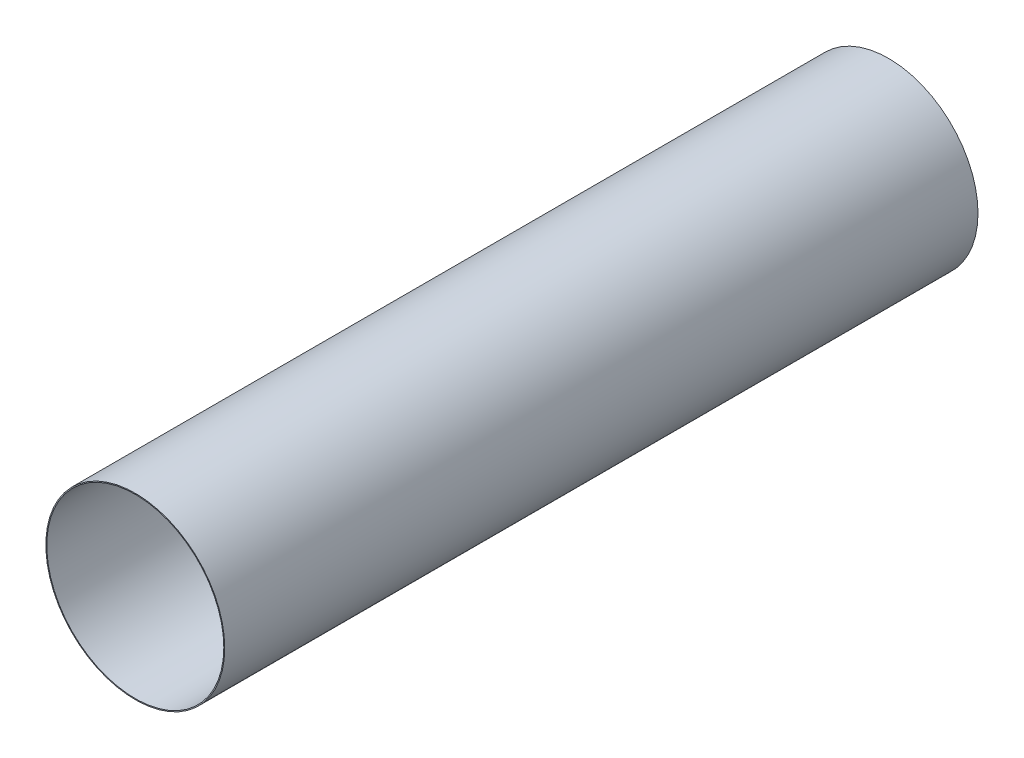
ISO-10303-21;
HEADER;
FILE_DESCRIPTION(('STEP AP214'),'2;1');
FILE_NAME('part.step','',(''),(''),'','','');
FILE_SCHEMA(('AUTOMOTIVE_DESIGN { 1 0 10303 214 1 1 1 1 }'));
ENDSEC;
DATA;
#1=APPLICATION_CONTEXT('core data for automotive mechanical design processes');
#2=APPLICATION_PROTOCOL_DEFINITION('international standard','automotive_design',2000,#1);
#3=PRODUCT_CONTEXT('',#1,'mechanical');
#4=PRODUCT('Part','Part','',(#3));
#5=PRODUCT_RELATED_PRODUCT_CATEGORY('part','',(#4));
#6=PRODUCT_DEFINITION_FORMATION('','',#4);
#7=PRODUCT_DEFINITION_CONTEXT('part definition',#1,'design');
#8=PRODUCT_DEFINITION('design','',#6,#7);
#9=PRODUCT_DEFINITION_SHAPE('','',#8);
#10=(LENGTH_UNIT() NAMED_UNIT(*) SI_UNIT(.MILLI.,.METRE.));
#11=(NAMED_UNIT(*) PLANE_ANGLE_UNIT() SI_UNIT($,.RADIAN.));
#12=(NAMED_UNIT(*) SI_UNIT($,.STERADIAN.) SOLID_ANGLE_UNIT());
#13=UNCERTAINTY_MEASURE_WITH_UNIT(LENGTH_MEASURE(1.E-05),#10,'distance_accuracy_value','');
#14=(GEOMETRIC_REPRESENTATION_CONTEXT(3) GLOBAL_UNCERTAINTY_ASSIGNED_CONTEXT((#13)) GLOBAL_UNIT_ASSIGNED_CONTEXT((#10,
#11,#12)) REPRESENTATION_CONTEXT('',''));
#15=CARTESIAN_POINT('',(0.,0.,0.));
#16=DIRECTION('',(0.,0.,1.));
#17=DIRECTION('',(1.,0.,0.));
#18=AXIS2_PLACEMENT_3D('',#15,#16,#17);
#19=CARTESIAN_POINT('',(0.,0.,80.));
#20=DIRECTION('',(0.,0.,1.));
#21=DIRECTION('',(1.,0.,0.));
#22=AXIS2_PLACEMENT_3D('',#19,#20,#21);
#23=PLANE('',#22);
#24=CARTESIAN_POINT('',(0.,0.,80.));
#25=DIRECTION('',(0.,0.,1.));
#26=DIRECTION('',(1.,0.,0.));
#27=AXIS2_PLACEMENT_3D('',#24,#25,#26);
#28=CIRCLE('',#27,19.);
#29=CARTESIAN_POINT('',(19.,0.,80.));
#30=VERTEX_POINT('',#29);
#31=EDGE_CURVE('E10',#30,#30,#28,.T.);
#32=ORIENTED_EDGE('',*,*,#31,.T.);
#33=EDGE_LOOP('',(#32));
#34=FACE_BOUND('',#33,.T.);
#35=CARTESIAN_POINT('',(0.,0.,80.));
#36=DIRECTION('',(0.,0.,1.));
#37=DIRECTION('',(1.,0.,0.));
#38=AXIS2_PLACEMENT_3D('',#35,#36,#37);
#39=CIRCLE('',#38,18.8);
#40=CARTESIAN_POINT('',(18.8,0.,80.));
#41=VERTEX_POINT('',#40);
#42=EDGE_CURVE('E41',#41,#41,#39,.T.);
#43=ORIENTED_EDGE('',*,*,#42,.F.);
#44=EDGE_LOOP('',(#43));
#45=FACE_BOUND('',#44,.T.);
#46=ADVANCED_FACE('F30',(#34,#45),#23,.T.);
#47=CARTESIAN_POINT('',(0.,0.,-80.));
#48=DIRECTION('',(0.,0.,1.));
#49=DIRECTION('',(1.,0.,0.));
#50=AXIS2_PLACEMENT_3D('',#47,#48,#49);
#51=PLANE('',#50);
#52=CARTESIAN_POINT('',(0.,0.,-80.));
#53=DIRECTION('',(0.,0.,1.));
#54=DIRECTION('',(1.,0.,0.));
#55=AXIS2_PLACEMENT_3D('',#52,#53,#54);
#56=CIRCLE('',#55,19.);
#57=CARTESIAN_POINT('',(19.,0.,-80.));
#58=VERTEX_POINT('',#57);
#59=EDGE_CURVE('E34',#58,#58,#56,.T.);
#60=ORIENTED_EDGE('',*,*,#59,.F.);
#61=EDGE_LOOP('',(#60));
#62=FACE_BOUND('',#61,.T.);
#63=CARTESIAN_POINT('',(0.,0.,-80.));
#64=DIRECTION('',(0.,0.,1.));
#65=DIRECTION('',(1.,0.,0.));
#66=AXIS2_PLACEMENT_3D('',#63,#64,#65);
#67=CIRCLE('',#66,18.8);
#68=CARTESIAN_POINT('',(18.8,0.,-80.));
#69=VERTEX_POINT('',#68);
#70=EDGE_CURVE('E43',#69,#69,#67,.T.);
#71=ORIENTED_EDGE('',*,*,#70,.T.);
#72=EDGE_LOOP('',(#71));
#73=FACE_BOUND('',#72,.T.);
#74=ADVANCED_FACE('F53',(#62,#73),#51,.F.);
#75=CARTESIAN_POINT('',(0.,0.,80.));
#76=DIRECTION('',(0.,0.,-1.));
#77=DIRECTION('',(-1.,0.,0.));
#78=AXIS2_PLACEMENT_3D('',#75,#76,#77);
#79=CYLINDRICAL_SURFACE('',#78,19.);
#80=ORIENTED_EDGE('',*,*,#31,.F.);
#81=EDGE_LOOP('',(#80));
#82=FACE_BOUND('',#81,.T.);
#83=ORIENTED_EDGE('',*,*,#59,.T.);
#84=EDGE_LOOP('',(#83));
#85=FACE_BOUND('',#84,.T.);
#86=ADVANCED_FACE('F32',(#82,#85),#79,.T.);
#87=CARTESIAN_POINT('',(0.,0.,80.));
#88=DIRECTION('',(0.,0.,-1.));
#89=DIRECTION('',(-1.,0.,0.));
#90=AXIS2_PLACEMENT_3D('',#87,#88,#89);
#91=CYLINDRICAL_SURFACE('',#90,18.8);
#92=ORIENTED_EDGE('',*,*,#42,.T.);
#93=EDGE_LOOP('',(#92));
#94=FACE_BOUND('',#93,.T.);
#95=ORIENTED_EDGE('',*,*,#70,.F.);
#96=EDGE_LOOP('',(#95));
#97=FACE_BOUND('',#96,.T.);
#98=ADVANCED_FACE('F49',(#94,#97),#91,.F.);
#99=CLOSED_SHELL('',(#46,#74,#86,#98));
#100=MANIFOLD_SOLID_BREP('B2',#99);
#101=ADVANCED_BREP_SHAPE_REPRESENTATION('',(#18,#100),#14);
#102=SHAPE_DEFINITION_REPRESENTATION(#9,#101);
ENDSEC;
END-ISO-10303-21;
